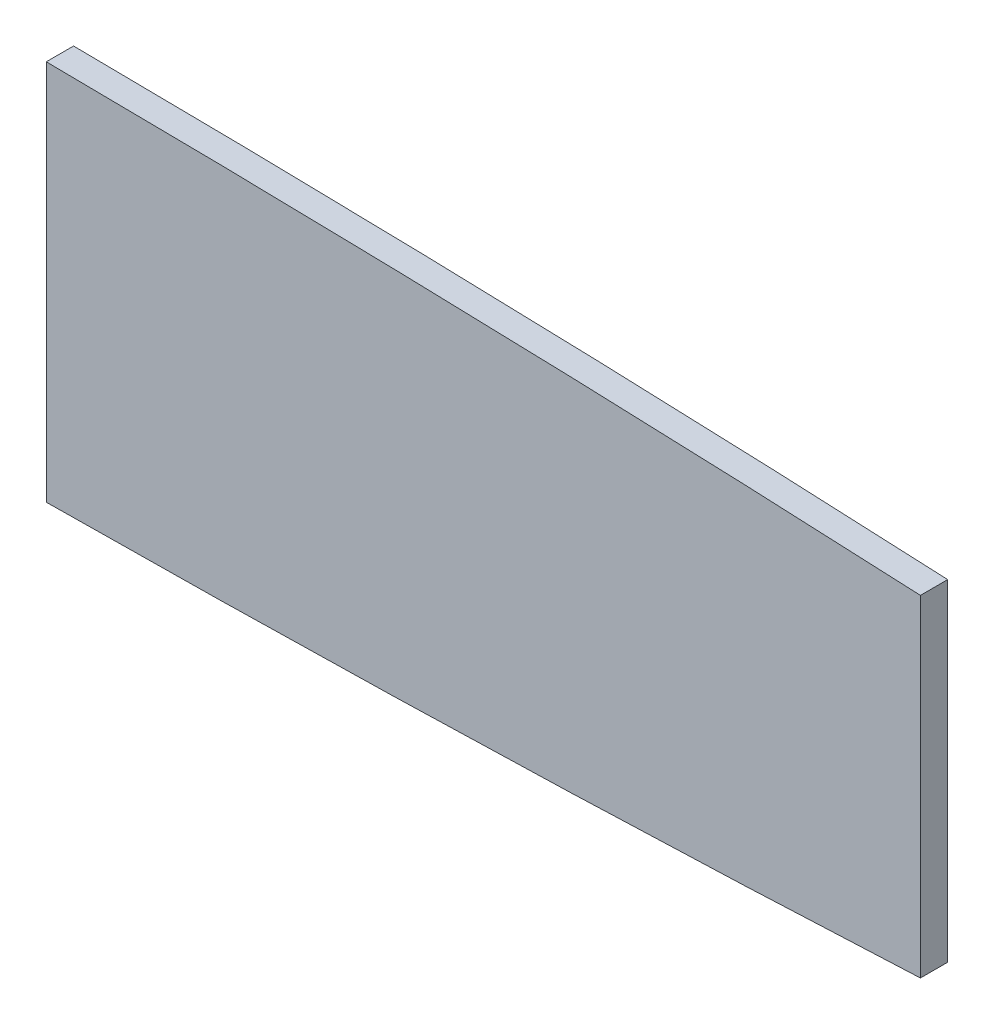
from build123d import *

# Parameters (mm, degrees)
BOSS_EXTRUDE1_DEPTH = 10


with BuildPart() as part:
    # Sketch1 → Boss-Extrude1 (new body)
    with BuildSketch(Plane.XY):
        with BuildLine():
            Line((159.996470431, -60.653415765), (159.996470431, 60.653415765))
            ThreePointArc((159.996470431, 60.653415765), (111.380724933, 62.902285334), (62.751767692, 64.844614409))
            ThreePointArc((62.751767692, 64.844614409), (-48.604397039, 68.136428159), (-159.996470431, 69.820900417))
            Line((-159.996470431, 69.820900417), (-159.996470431, -69.820900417))
            ThreePointArc((-159.996470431, -69.820900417), (-48.604397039, -68.136428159), (62.751767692, -64.844614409))
            ThreePointArc((62.751767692, -64.844614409), (111.380724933, -62.902285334), (159.996470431, -60.653415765))
        make_face()
    extrude(amount=BOSS_EXTRUDE1_DEPTH)


solid = part.part
